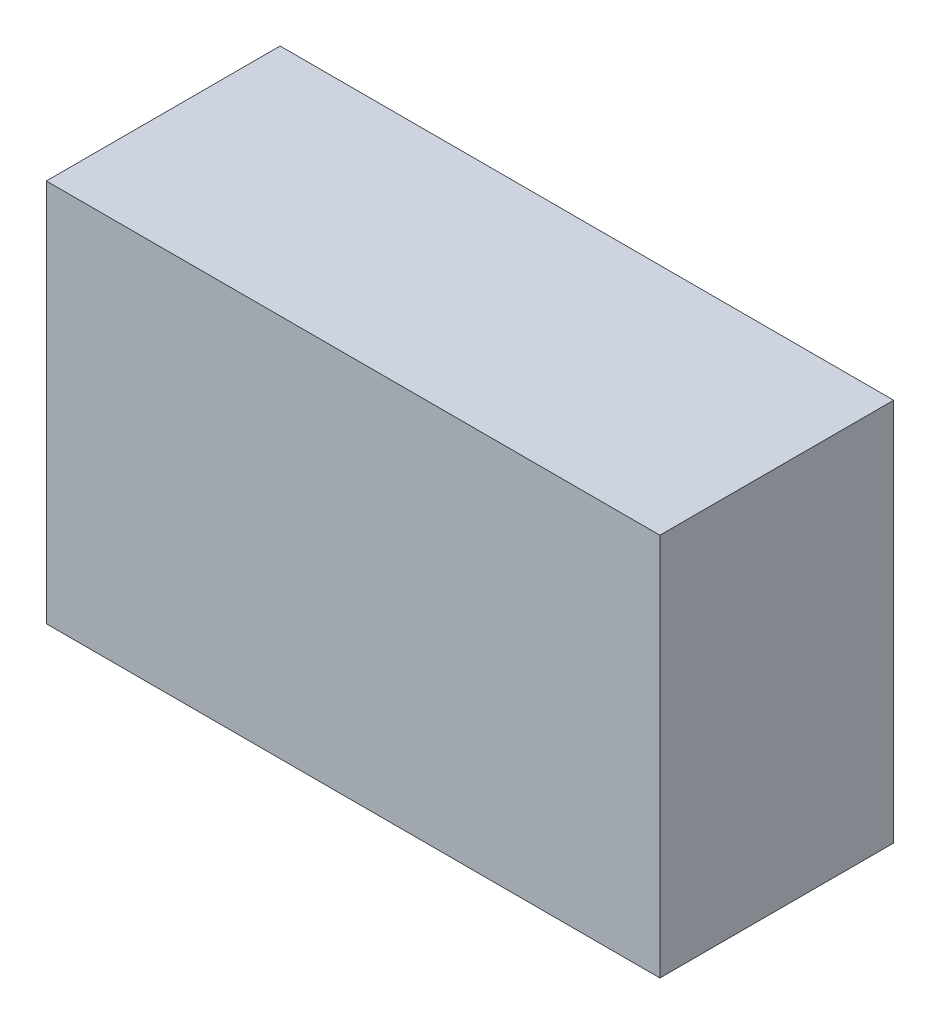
ISO-10303-21;
HEADER;
FILE_DESCRIPTION(('STEP AP214'),'2;1');
FILE_NAME('part.step','',(''),(''),'','','');
FILE_SCHEMA(('AUTOMOTIVE_DESIGN { 1 0 10303 214 1 1 1 1 }'));
ENDSEC;
DATA;
#1=APPLICATION_CONTEXT('core data for automotive mechanical design processes');
#2=APPLICATION_PROTOCOL_DEFINITION('international standard','automotive_design',2000,#1);
#3=PRODUCT_CONTEXT('',#1,'mechanical');
#4=PRODUCT('Part','Part','',(#3));
#5=PRODUCT_RELATED_PRODUCT_CATEGORY('part','',(#4));
#6=PRODUCT_DEFINITION_FORMATION('','',#4);
#7=PRODUCT_DEFINITION_CONTEXT('part definition',#1,'design');
#8=PRODUCT_DEFINITION('design','',#6,#7);
#9=PRODUCT_DEFINITION_SHAPE('','',#8);
#10=(LENGTH_UNIT() NAMED_UNIT(*) SI_UNIT(.MILLI.,.METRE.));
#11=(NAMED_UNIT(*) PLANE_ANGLE_UNIT() SI_UNIT($,.RADIAN.));
#12=(NAMED_UNIT(*) SI_UNIT($,.STERADIAN.) SOLID_ANGLE_UNIT());
#13=UNCERTAINTY_MEASURE_WITH_UNIT(LENGTH_MEASURE(1.E-05),#10,'distance_accuracy_value','');
#14=(GEOMETRIC_REPRESENTATION_CONTEXT(3) GLOBAL_UNCERTAINTY_ASSIGNED_CONTEXT((#13)) GLOBAL_UNIT_ASSIGNED_CONTEXT((#10,
#11,#12)) REPRESENTATION_CONTEXT('',''));
#15=CARTESIAN_POINT('',(0.,0.,0.));
#16=DIRECTION('',(0.,0.,1.));
#17=DIRECTION('',(1.,0.,0.));
#18=AXIS2_PLACEMENT_3D('',#15,#16,#17);
#19=CARTESIAN_POINT('',(-1.778,-0.889,0.762));
#20=DIRECTION('',(1.,0.,0.));
#21=DIRECTION('',(0.,0.,-1.));
#22=AXIS2_PLACEMENT_3D('',#19,#20,#21);
#23=PLANE('',#22);
#24=DIRECTION('',(0.,-1.,0.));
#25=VECTOR('',#24,1.);
#26=CARTESIAN_POINT('',(-1.778,-0.889,0.));
#27=LINE('',#26,#25);
#28=CARTESIAN_POINT('',(-1.778,0.361,0.));
#29=VERTEX_POINT('',#28);
#30=CARTESIAN_POINT('',(-1.778,-0.889,0.));
#31=VERTEX_POINT('',#30);
#32=EDGE_CURVE('E95',#29,#31,#27,.T.);
#33=ORIENTED_EDGE('',*,*,#32,.T.);
#34=DIRECTION('',(0.,0.,-1.));
#35=VECTOR('',#34,1.);
#36=CARTESIAN_POINT('',(-1.778,-0.889,0.762));
#37=LINE('',#36,#35);
#38=CARTESIAN_POINT('',(-1.778,-0.889,0.762));
#39=VERTEX_POINT('',#38);
#40=EDGE_CURVE('E11',#39,#31,#37,.T.);
#41=ORIENTED_EDGE('',*,*,#40,.F.);
#42=DIRECTION('',(0.,-1.,0.));
#43=VECTOR('',#42,1.);
#44=CARTESIAN_POINT('',(-1.778,-0.889,0.762));
#45=LINE('',#44,#43);
#46=CARTESIAN_POINT('',(-1.778,0.361,0.762));
#47=VERTEX_POINT('',#46);
#48=EDGE_CURVE('E83',#47,#39,#45,.T.);
#49=ORIENTED_EDGE('',*,*,#48,.F.);
#50=DIRECTION('',(0.,0.,-1.));
#51=VECTOR('',#50,1.);
#52=CARTESIAN_POINT('',(-1.778,0.361,0.762));
#53=LINE('',#52,#51);
#54=EDGE_CURVE('E91',#47,#29,#53,.T.);
#55=ORIENTED_EDGE('',*,*,#54,.T.);
#56=EDGE_LOOP('',(#33,#41,#49,#55));
#57=FACE_BOUND('',#56,.T.);
#58=ADVANCED_FACE('F32',(#57),#23,.F.);
#59=CARTESIAN_POINT('',(0.222,-0.889,0.762));
#60=DIRECTION('',(0.,1.,0.));
#61=DIRECTION('',(0.,0.,1.));
#62=AXIS2_PLACEMENT_3D('',#59,#60,#61);
#63=PLANE('',#62);
#64=DIRECTION('',(1.,0.,0.));
#65=VECTOR('',#64,1.);
#66=CARTESIAN_POINT('',(0.222,-0.889,0.));
#67=LINE('',#66,#65);
#68=CARTESIAN_POINT('',(0.222,-0.889,0.));
#69=VERTEX_POINT('',#68);
#70=EDGE_CURVE('E87',#31,#69,#67,.T.);
#71=ORIENTED_EDGE('',*,*,#70,.T.);
#72=DIRECTION('',(0.,0.,-1.));
#73=VECTOR('',#72,1.);
#74=CARTESIAN_POINT('',(0.222,-0.889,0.762));
#75=LINE('',#74,#73);
#76=CARTESIAN_POINT('',(0.222,-0.889,0.762));
#77=VERTEX_POINT('',#76);
#78=EDGE_CURVE('E40',#77,#69,#75,.T.);
#79=ORIENTED_EDGE('',*,*,#78,.F.);
#80=DIRECTION('',(1.,0.,0.));
#81=VECTOR('',#80,1.);
#82=CARTESIAN_POINT('',(0.222,-0.889,0.762));
#83=LINE('',#82,#81);
#84=EDGE_CURVE('E78',#39,#77,#83,.T.);
#85=ORIENTED_EDGE('',*,*,#84,.F.);
#86=ORIENTED_EDGE('',*,*,#40,.T.);
#87=EDGE_LOOP('',(#71,#79,#85,#86));
#88=FACE_BOUND('',#87,.T.);
#89=ADVANCED_FACE('F86',(#88),#63,.F.);
#90=CARTESIAN_POINT('',(0.222,0.361,0.762));
#91=DIRECTION('',(-1.,0.,0.));
#92=DIRECTION('',(0.,-1.,0.));
#93=AXIS2_PLACEMENT_3D('',#90,#91,#92);
#94=PLANE('',#93);
#95=DIRECTION('',(0.,1.,0.));
#96=VECTOR('',#95,1.);
#97=CARTESIAN_POINT('',(0.222,0.361,0.));
#98=LINE('',#97,#96);
#99=CARTESIAN_POINT('',(0.222,0.361,0.));
#100=VERTEX_POINT('',#99);
#101=EDGE_CURVE('E65',#69,#100,#98,.T.);
#102=ORIENTED_EDGE('',*,*,#101,.T.);
#103=DIRECTION('',(0.,0.,-1.));
#104=VECTOR('',#103,1.);
#105=CARTESIAN_POINT('',(0.222,0.361,0.762));
#106=LINE('',#105,#104);
#107=CARTESIAN_POINT('',(0.222,0.361,0.762));
#108=VERTEX_POINT('',#107);
#109=EDGE_CURVE('E88',#108,#100,#106,.T.);
#110=ORIENTED_EDGE('',*,*,#109,.F.);
#111=DIRECTION('',(0.,1.,0.));
#112=VECTOR('',#111,1.);
#113=CARTESIAN_POINT('',(0.222,0.361,0.762));
#114=LINE('',#113,#112);
#115=EDGE_CURVE('E81',#77,#108,#114,.T.);
#116=ORIENTED_EDGE('',*,*,#115,.F.);
#117=ORIENTED_EDGE('',*,*,#78,.T.);
#118=EDGE_LOOP('',(#102,#110,#116,#117));
#119=FACE_BOUND('',#118,.T.);
#120=ADVANCED_FACE('F89',(#119),#94,.F.);
#121=CARTESIAN_POINT('',(-1.778,0.361,0.762));
#122=DIRECTION('',(0.,-1.,0.));
#123=DIRECTION('',(1.,0.,0.));
#124=AXIS2_PLACEMENT_3D('',#121,#122,#123);
#125=PLANE('',#124);
#126=DIRECTION('',(-1.,0.,0.));
#127=VECTOR('',#126,1.);
#128=CARTESIAN_POINT('',(-1.778,0.361,0.));
#129=LINE('',#128,#127);
#130=EDGE_CURVE('E71',#100,#29,#129,.T.);
#131=ORIENTED_EDGE('',*,*,#130,.T.);
#132=ORIENTED_EDGE('',*,*,#54,.F.);
#133=DIRECTION('',(-1.,0.,0.));
#134=VECTOR('',#133,1.);
#135=CARTESIAN_POINT('',(-1.778,0.361,0.762));
#136=LINE('',#135,#134);
#137=EDGE_CURVE('E48',#108,#47,#136,.T.);
#138=ORIENTED_EDGE('',*,*,#137,.F.);
#139=ORIENTED_EDGE('',*,*,#109,.T.);
#140=EDGE_LOOP('',(#131,#132,#138,#139));
#141=FACE_BOUND('',#140,.T.);
#142=ADVANCED_FACE('F102',(#141),#125,.F.);
#143=CARTESIAN_POINT('',(0.,0.,0.762));
#144=DIRECTION('',(0.,0.,-1.));
#145=DIRECTION('',(-1.,0.,0.));
#146=AXIS2_PLACEMENT_3D('',#143,#144,#145);
#147=PLANE('',#146);
#148=ORIENTED_EDGE('',*,*,#48,.T.);
#149=ORIENTED_EDGE('',*,*,#84,.T.);
#150=ORIENTED_EDGE('',*,*,#115,.T.);
#151=ORIENTED_EDGE('',*,*,#137,.T.);
#152=EDGE_LOOP('',(#148,#149,#150,#151));
#153=FACE_BOUND('',#152,.T.);
#154=ADVANCED_FACE('F79',(#153),#147,.F.);
#155=CARTESIAN_POINT('',(0.,0.,0.));
#156=DIRECTION('',(0.,0.,-1.));
#157=DIRECTION('',(-1.,0.,0.));
#158=AXIS2_PLACEMENT_3D('',#155,#156,#157);
#159=PLANE('',#158);
#160=ORIENTED_EDGE('',*,*,#32,.F.);
#161=ORIENTED_EDGE('',*,*,#130,.F.);
#162=ORIENTED_EDGE('',*,*,#101,.F.);
#163=ORIENTED_EDGE('',*,*,#70,.F.);
#164=EDGE_LOOP('',(#160,#161,#162,#163));
#165=FACE_BOUND('',#164,.T.);
#166=ADVANCED_FACE('F105',(#165),#159,.T.);
#167=CLOSED_SHELL('',(#58,#89,#120,#142,#154,#166));
#168=MANIFOLD_SOLID_BREP('B2',#167);
#169=ADVANCED_BREP_SHAPE_REPRESENTATION('',(#18,#168),#14);
#170=SHAPE_DEFINITION_REPRESENTATION(#9,#169);
ENDSEC;
END-ISO-10303-21;
